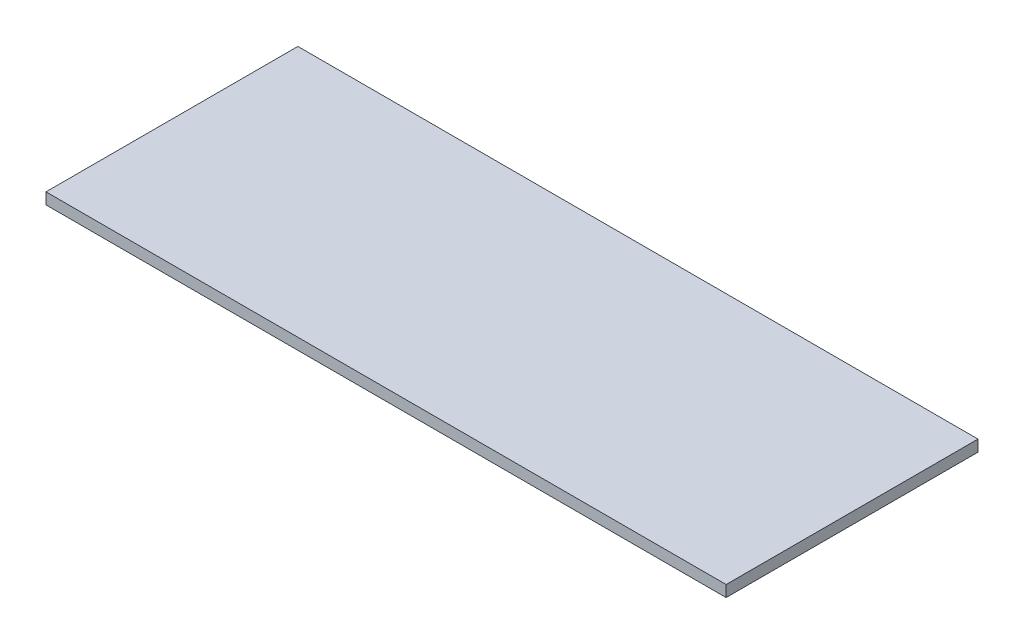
ISO-10303-21;
HEADER;
FILE_DESCRIPTION(('STEP AP214'),'2;1');
FILE_NAME('part.step','',(''),(''),'','','');
FILE_SCHEMA(('AUTOMOTIVE_DESIGN { 1 0 10303 214 1 1 1 1 }'));
ENDSEC;
DATA;
#1=APPLICATION_CONTEXT('core data for automotive mechanical design processes');
#2=APPLICATION_PROTOCOL_DEFINITION('international standard','automotive_design',2000,#1);
#3=PRODUCT_CONTEXT('',#1,'mechanical');
#4=PRODUCT('Part','Part','',(#3));
#5=PRODUCT_RELATED_PRODUCT_CATEGORY('part','',(#4));
#6=PRODUCT_DEFINITION_FORMATION('','',#4);
#7=PRODUCT_DEFINITION_CONTEXT('part definition',#1,'design');
#8=PRODUCT_DEFINITION('design','',#6,#7);
#9=PRODUCT_DEFINITION_SHAPE('','',#8);
#10=(LENGTH_UNIT() NAMED_UNIT(*) SI_UNIT(.MILLI.,.METRE.));
#11=(NAMED_UNIT(*) PLANE_ANGLE_UNIT() SI_UNIT($,.RADIAN.));
#12=(NAMED_UNIT(*) SI_UNIT($,.STERADIAN.) SOLID_ANGLE_UNIT());
#13=UNCERTAINTY_MEASURE_WITH_UNIT(LENGTH_MEASURE(1.E-05),#10,'distance_accuracy_value','');
#14=(GEOMETRIC_REPRESENTATION_CONTEXT(3) GLOBAL_UNCERTAINTY_ASSIGNED_CONTEXT((#13)) GLOBAL_UNIT_ASSIGNED_CONTEXT((#10,
#11,#12)) REPRESENTATION_CONTEXT('',''));
#15=CARTESIAN_POINT('',(0.,0.,0.));
#16=DIRECTION('',(0.,0.,1.));
#17=DIRECTION('',(1.,0.,0.));
#18=AXIS2_PLACEMENT_3D('',#15,#16,#17);
#19=CARTESIAN_POINT('',(76.2,2.54,-28.2194));
#20=DIRECTION('',(-1.,0.,0.));
#21=DIRECTION('',(0.,0.,1.));
#22=AXIS2_PLACEMENT_3D('',#19,#20,#21);
#23=PLANE('',#22);
#24=DIRECTION('',(0.,0.,-1.));
#25=VECTOR('',#24,1.);
#26=CARTESIAN_POINT('',(76.2,0.,-28.2194));
#27=LINE('',#26,#25);
#28=CARTESIAN_POINT('',(76.2,0.,28.2194));
#29=VERTEX_POINT('',#28);
#30=CARTESIAN_POINT('',(76.2,0.,-28.2194));
#31=VERTEX_POINT('',#30);
#32=EDGE_CURVE('E100',#29,#31,#27,.T.);
#33=ORIENTED_EDGE('',*,*,#32,.T.);
#34=DIRECTION('',(0.,-1.,0.));
#35=VECTOR('',#34,1.);
#36=CARTESIAN_POINT('',(76.2,2.54,-28.2194));
#37=LINE('',#36,#35);
#38=CARTESIAN_POINT('',(76.2,2.54,-28.2194));
#39=VERTEX_POINT('',#38);
#40=EDGE_CURVE('E11',#39,#31,#37,.T.);
#41=ORIENTED_EDGE('',*,*,#40,.F.);
#42=DIRECTION('',(0.,0.,-1.));
#43=VECTOR('',#42,1.);
#44=CARTESIAN_POINT('',(76.2,2.54,-28.2194));
#45=LINE('',#44,#43);
#46=CARTESIAN_POINT('',(76.2,2.54,28.2194));
#47=VERTEX_POINT('',#46);
#48=EDGE_CURVE('E88',#47,#39,#45,.T.);
#49=ORIENTED_EDGE('',*,*,#48,.F.);
#50=DIRECTION('',(0.,-1.,0.));
#51=VECTOR('',#50,1.);
#52=CARTESIAN_POINT('',(76.2,2.54,28.2194));
#53=LINE('',#52,#51);
#54=EDGE_CURVE('E96',#47,#29,#53,.T.);
#55=ORIENTED_EDGE('',*,*,#54,.T.);
#56=EDGE_LOOP('',(#33,#41,#49,#55));
#57=FACE_BOUND('',#56,.T.);
#58=ADVANCED_FACE('F37',(#57),#23,.F.);
#59=CARTESIAN_POINT('',(-76.2,2.54,-28.2194));
#60=DIRECTION('',(0.,0.,1.));
#61=DIRECTION('',(1.,0.,0.));
#62=AXIS2_PLACEMENT_3D('',#59,#60,#61);
#63=PLANE('',#62);
#64=DIRECTION('',(-1.,0.,0.));
#65=VECTOR('',#64,1.);
#66=CARTESIAN_POINT('',(-76.2,0.,-28.2194));
#67=LINE('',#66,#65);
#68=CARTESIAN_POINT('',(-76.2,0.,-28.2194));
#69=VERTEX_POINT('',#68);
#70=EDGE_CURVE('E92',#31,#69,#67,.T.);
#71=ORIENTED_EDGE('',*,*,#70,.T.);
#72=DIRECTION('',(0.,-1.,0.));
#73=VECTOR('',#72,1.);
#74=CARTESIAN_POINT('',(-76.2,2.54,-28.2194));
#75=LINE('',#74,#73);
#76=CARTESIAN_POINT('',(-76.2,2.54,-28.2194));
#77=VERTEX_POINT('',#76);
#78=EDGE_CURVE('E45',#77,#69,#75,.T.);
#79=ORIENTED_EDGE('',*,*,#78,.F.);
#80=DIRECTION('',(-1.,0.,0.));
#81=VECTOR('',#80,1.);
#82=CARTESIAN_POINT('',(-76.2,2.54,-28.2194));
#83=LINE('',#82,#81);
#84=EDGE_CURVE('E83',#39,#77,#83,.T.);
#85=ORIENTED_EDGE('',*,*,#84,.F.);
#86=ORIENTED_EDGE('',*,*,#40,.T.);
#87=EDGE_LOOP('',(#71,#79,#85,#86));
#88=FACE_BOUND('',#87,.T.);
#89=ADVANCED_FACE('F91',(#88),#63,.F.);
#90=CARTESIAN_POINT('',(-76.2,2.54,-28.2194));
#91=DIRECTION('',(1.,0.,0.));
#92=DIRECTION('',(0.,0.,-1.));
#93=AXIS2_PLACEMENT_3D('',#90,#91,#92);
#94=PLANE('',#93);
#95=DIRECTION('',(0.,0.,1.));
#96=VECTOR('',#95,1.);
#97=CARTESIAN_POINT('',(-76.2,0.,-28.2194));
#98=LINE('',#97,#96);
#99=CARTESIAN_POINT('',(-76.2,0.,28.2194));
#100=VERTEX_POINT('',#99);
#101=EDGE_CURVE('E70',#69,#100,#98,.T.);
#102=ORIENTED_EDGE('',*,*,#101,.T.);
#103=DIRECTION('',(0.,-1.,0.));
#104=VECTOR('',#103,1.);
#105=CARTESIAN_POINT('',(-76.2,2.54,28.2194));
#106=LINE('',#105,#104);
#107=CARTESIAN_POINT('',(-76.2,2.54,28.2194));
#108=VERTEX_POINT('',#107);
#109=EDGE_CURVE('E93',#108,#100,#106,.T.);
#110=ORIENTED_EDGE('',*,*,#109,.F.);
#111=DIRECTION('',(0.,0.,1.));
#112=VECTOR('',#111,1.);
#113=CARTESIAN_POINT('',(-76.2,2.54,-28.2194));
#114=LINE('',#113,#112);
#115=EDGE_CURVE('E86',#77,#108,#114,.T.);
#116=ORIENTED_EDGE('',*,*,#115,.F.);
#117=ORIENTED_EDGE('',*,*,#78,.T.);
#118=EDGE_LOOP('',(#102,#110,#116,#117));
#119=FACE_BOUND('',#118,.T.);
#120=ADVANCED_FACE('F94',(#119),#94,.F.);
#121=CARTESIAN_POINT('',(-76.2,2.54,28.2194));
#122=DIRECTION('',(0.,0.,-1.));
#123=DIRECTION('',(-1.,0.,0.));
#124=AXIS2_PLACEMENT_3D('',#121,#122,#123);
#125=PLANE('',#124);
#126=DIRECTION('',(1.,0.,0.));
#127=VECTOR('',#126,1.);
#128=CARTESIAN_POINT('',(-76.2,0.,28.2194));
#129=LINE('',#128,#127);
#130=EDGE_CURVE('E76',#100,#29,#129,.T.);
#131=ORIENTED_EDGE('',*,*,#130,.T.);
#132=ORIENTED_EDGE('',*,*,#54,.F.);
#133=DIRECTION('',(1.,0.,0.));
#134=VECTOR('',#133,1.);
#135=CARTESIAN_POINT('',(-76.2,2.54,28.2194));
#136=LINE('',#135,#134);
#137=EDGE_CURVE('E53',#108,#47,#136,.T.);
#138=ORIENTED_EDGE('',*,*,#137,.F.);
#139=ORIENTED_EDGE('',*,*,#109,.T.);
#140=EDGE_LOOP('',(#131,#132,#138,#139));
#141=FACE_BOUND('',#140,.T.);
#142=ADVANCED_FACE('F107',(#141),#125,.F.);
#143=CARTESIAN_POINT('',(0.,2.54,0.));
#144=DIRECTION('',(0.,1.,0.));
#145=DIRECTION('',(0.,0.,1.));
#146=AXIS2_PLACEMENT_3D('',#143,#144,#145);
#147=PLANE('',#146);
#148=ORIENTED_EDGE('',*,*,#48,.T.);
#149=ORIENTED_EDGE('',*,*,#84,.T.);
#150=ORIENTED_EDGE('',*,*,#115,.T.);
#151=ORIENTED_EDGE('',*,*,#137,.T.);
#152=EDGE_LOOP('',(#148,#149,#150,#151));
#153=FACE_BOUND('',#152,.T.);
#154=ADVANCED_FACE('F84',(#153),#147,.T.);
#155=CARTESIAN_POINT('',(0.,0.,0.));
#156=DIRECTION('',(0.,1.,0.));
#157=DIRECTION('',(0.,0.,1.));
#158=AXIS2_PLACEMENT_3D('',#155,#156,#157);
#159=PLANE('',#158);
#160=ORIENTED_EDGE('',*,*,#32,.F.);
#161=ORIENTED_EDGE('',*,*,#130,.F.);
#162=ORIENTED_EDGE('',*,*,#101,.F.);
#163=ORIENTED_EDGE('',*,*,#70,.F.);
#164=EDGE_LOOP('',(#160,#161,#162,#163));
#165=FACE_BOUND('',#164,.T.);
#166=ADVANCED_FACE('F110',(#165),#159,.F.);
#167=CLOSED_SHELL('',(#58,#89,#120,#142,#154,#166));
#168=MANIFOLD_SOLID_BREP('B2',#167);
#169=ADVANCED_BREP_SHAPE_REPRESENTATION('',(#18,#168),#14);
#170=SHAPE_DEFINITION_REPRESENTATION(#9,#169);
ENDSEC;
END-ISO-10303-21;
